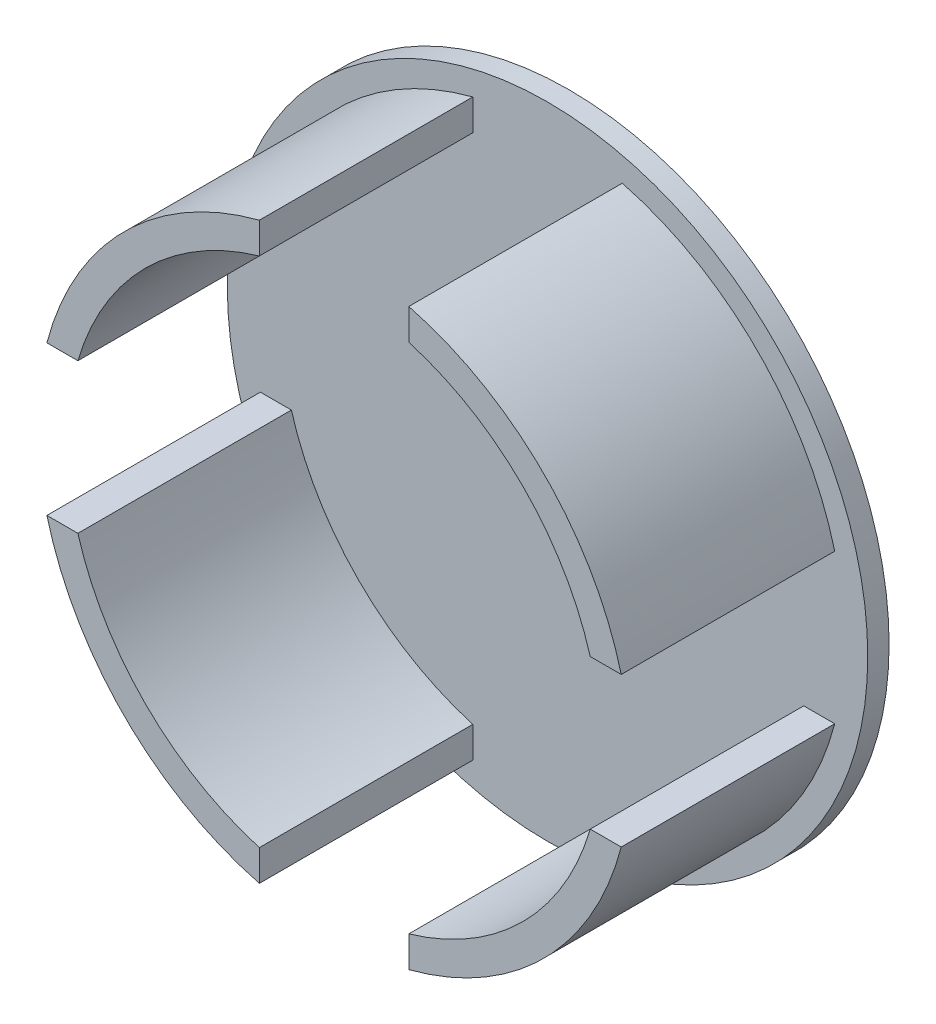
from build123d import *

# Parameters (mm, degrees)
IZIM1_R                     = 15
Y_KSEKLIK_EKSTR_ZYON1_DEPTH = 1
IZIM2_R                     = 13.9
IZIM2_R_2                   = 12.5
Y_KSEKLIK_EKSTR_ZYON2_DEPTH = 10
KES_EKSTR_ZYON1_DEPTH       = 10


with BuildPart() as part:
    # izim1 → Y_kseklik-Ekstr_zyon1 (new body)
    with BuildSketch(Plane.XY):
        Circle(IZIM1_R)
    extrude(amount=Y_KSEKLIK_EKSTR_ZYON1_DEPTH)

    # izim2 → Y_kseklik-Ekstr_zyon2 (add)
    with BuildSketch(Plane.XY.offset(1)):
        Circle(IZIM2_R)
        Circle(IZIM2_R_2, mode=Mode.SUBTRACT)
    extrude(amount=Y_KSEKLIK_EKSTR_ZYON2_DEPTH)

    # izim3 → Kes-Ekstr_zyon1 (cut)
    with BuildSketch(Plane.XY.offset(11)):
        Polygon((-3.5, -3.5), (-3.5, -18.302904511), (3.5, -18.302904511), (3.5, -3.5), (20.711529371, -3.5), (20.711529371, 3.5), (3.5, 3.5), (3.5, 18.302904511), (-3.5, 18.302904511), (-3.5, 3.5), (-20.711529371, 3.5), (-20.711529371, -3.5), align=None)
    extrude(amount=-KES_EKSTR_ZYON1_DEPTH, mode=Mode.SUBTRACT)


solid = part.part
